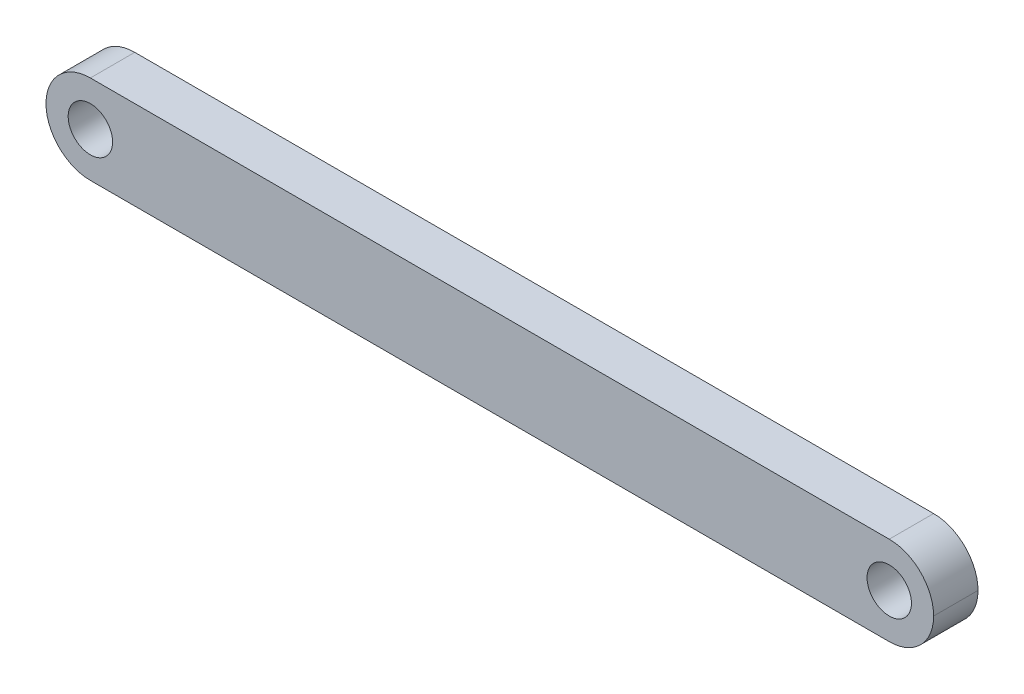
ISO-10303-21;
HEADER;
FILE_DESCRIPTION(('STEP AP214'),'2;1');
FILE_NAME('part.step','',(''),(''),'','','');
FILE_SCHEMA(('AUTOMOTIVE_DESIGN { 1 0 10303 214 1 1 1 1 }'));
ENDSEC;
DATA;
#1=APPLICATION_CONTEXT('core data for automotive mechanical design processes');
#2=APPLICATION_PROTOCOL_DEFINITION('international standard','automotive_design',2000,#1);
#3=PRODUCT_CONTEXT('',#1,'mechanical');
#4=PRODUCT('Part','Part','',(#3));
#5=PRODUCT_RELATED_PRODUCT_CATEGORY('part','',(#4));
#6=PRODUCT_DEFINITION_FORMATION('','',#4);
#7=PRODUCT_DEFINITION_CONTEXT('part definition',#1,'design');
#8=PRODUCT_DEFINITION('design','',#6,#7);
#9=PRODUCT_DEFINITION_SHAPE('','',#8);
#10=(LENGTH_UNIT() NAMED_UNIT(*) SI_UNIT(.MILLI.,.METRE.));
#11=(NAMED_UNIT(*) PLANE_ANGLE_UNIT() SI_UNIT($,.RADIAN.));
#12=(NAMED_UNIT(*) SI_UNIT($,.STERADIAN.) SOLID_ANGLE_UNIT());
#13=UNCERTAINTY_MEASURE_WITH_UNIT(LENGTH_MEASURE(1.E-05),#10,'distance_accuracy_value','');
#14=(GEOMETRIC_REPRESENTATION_CONTEXT(3) GLOBAL_UNCERTAINTY_ASSIGNED_CONTEXT((#13)) GLOBAL_UNIT_ASSIGNED_CONTEXT((#10,
#11,#12)) REPRESENTATION_CONTEXT('',''));
#15=CARTESIAN_POINT('',(0.,0.,0.));
#16=DIRECTION('',(0.,0.,1.));
#17=DIRECTION('',(1.,0.,0.));
#18=AXIS2_PLACEMENT_3D('',#15,#16,#17);
#19=CARTESIAN_POINT('',(0.,0.,10.));
#20=DIRECTION('',(0.,1.,0.));
#21=DIRECTION('',(0.,0.,1.));
#22=AXIS2_PLACEMENT_3D('',#19,#20,#21);
#23=PLANE('',#22);
#24=DIRECTION('',(1.,0.,0.));
#25=VECTOR('',#24,1.);
#26=CARTESIAN_POINT('',(0.,0.,0.));
#27=LINE('',#26,#25);
#28=CARTESIAN_POINT('',(10.,0.,0.));
#29=VERTEX_POINT('',#28);
#30=CARTESIAN_POINT('',(190.,0.,0.));
#31=VERTEX_POINT('',#30);
#32=EDGE_CURVE('E91',#29,#31,#27,.T.);
#33=ORIENTED_EDGE('',*,*,#32,.T.);
#34=DIRECTION('',(0.,0.,-1.));
#35=VECTOR('',#34,1.);
#36=CARTESIAN_POINT('',(190.,0.,10.));
#37=LINE('',#36,#35);
#38=CARTESIAN_POINT('',(190.,0.,10.));
#39=VERTEX_POINT('',#38);
#40=EDGE_CURVE('E133',#31,#39,#37,.F.);
#41=ORIENTED_EDGE('',*,*,#40,.T.);
#42=DIRECTION('',(1.,0.,0.));
#43=VECTOR('',#42,1.);
#44=CARTESIAN_POINT('',(0.,0.,10.));
#45=LINE('',#44,#43);
#46=CARTESIAN_POINT('',(10.,0.,10.));
#47=VERTEX_POINT('',#46);
#48=EDGE_CURVE('E121',#47,#39,#45,.T.);
#49=ORIENTED_EDGE('',*,*,#48,.F.);
#50=DIRECTION('',(0.,0.,-1.));
#51=VECTOR('',#50,1.);
#52=CARTESIAN_POINT('',(10.,0.,10.));
#53=LINE('',#52,#51);
#54=EDGE_CURVE('E131',#47,#29,#53,.T.);
#55=ORIENTED_EDGE('',*,*,#54,.T.);
#56=EDGE_LOOP('',(#33,#41,#49,#55));
#57=FACE_BOUND('',#56,.T.);
#58=ADVANCED_FACE('F32',(#57),#23,.F.);
#59=CARTESIAN_POINT('',(0.,20.,10.));
#60=DIRECTION('',(0.,-1.,0.));
#61=DIRECTION('',(0.,0.,-1.));
#62=AXIS2_PLACEMENT_3D('',#59,#60,#61);
#63=PLANE('',#62);
#64=DIRECTION('',(-1.,0.,0.));
#65=VECTOR('',#64,1.);
#66=CARTESIAN_POINT('',(0.,20.,10.));
#67=LINE('',#66,#65);
#68=CARTESIAN_POINT('',(190.,20.,10.));
#69=VERTEX_POINT('',#68);
#70=CARTESIAN_POINT('',(10.,20.,10.));
#71=VERTEX_POINT('',#70);
#72=EDGE_CURVE('E102',#69,#71,#67,.T.);
#73=ORIENTED_EDGE('',*,*,#72,.F.);
#74=DIRECTION('',(0.,0.,-1.));
#75=VECTOR('',#74,1.);
#76=CARTESIAN_POINT('',(190.,20.,10.));
#77=LINE('',#76,#75);
#78=CARTESIAN_POINT('',(190.,20.,0.));
#79=VERTEX_POINT('',#78);
#80=EDGE_CURVE('E11',#69,#79,#77,.T.);
#81=ORIENTED_EDGE('',*,*,#80,.T.);
#82=DIRECTION('',(-1.,0.,0.));
#83=VECTOR('',#82,1.);
#84=CARTESIAN_POINT('',(0.,20.,0.));
#85=LINE('',#84,#83);
#86=CARTESIAN_POINT('',(10.,20.,0.));
#87=VERTEX_POINT('',#86);
#88=EDGE_CURVE('E124',#79,#87,#85,.T.);
#89=ORIENTED_EDGE('',*,*,#88,.T.);
#90=DIRECTION('',(0.,0.,-1.));
#91=VECTOR('',#90,1.);
#92=CARTESIAN_POINT('',(10.,20.,10.));
#93=LINE('',#92,#91);
#94=EDGE_CURVE('E41',#87,#71,#93,.F.);
#95=ORIENTED_EDGE('',*,*,#94,.T.);
#96=EDGE_LOOP('',(#73,#81,#89,#95));
#97=FACE_BOUND('',#96,.T.);
#98=ADVANCED_FACE('F155',(#97),#63,.F.);
#99=CARTESIAN_POINT('',(0.,0.,10.));
#100=DIRECTION('',(0.,0.,-1.));
#101=DIRECTION('',(-1.,0.,0.));
#102=AXIS2_PLACEMENT_3D('',#99,#100,#101);
#103=PLANE('',#102);
#104=CARTESIAN_POINT('',(190.,10.,10.));
#105=DIRECTION('',(0.,0.,1.));
#106=DIRECTION('',(1.,0.,0.));
#107=AXIS2_PLACEMENT_3D('',#104,#105,#106);
#108=CIRCLE('',#107,4.99999999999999);
#109=CARTESIAN_POINT('',(195.,10.,10.));
#110=VERTEX_POINT('',#109);
#111=EDGE_CURVE('E118',#110,#110,#108,.T.);
#112=ORIENTED_EDGE('',*,*,#111,.F.);
#113=EDGE_LOOP('',(#112));
#114=FACE_BOUND('',#113,.T.);
#115=CARTESIAN_POINT('',(10.,10.,10.));
#116=DIRECTION('',(0.,0.,1.));
#117=DIRECTION('',(1.,0.,0.));
#118=AXIS2_PLACEMENT_3D('',#115,#116,#117);
#119=CIRCLE('',#118,5.);
#120=CARTESIAN_POINT('',(15.,10.,10.));
#121=VERTEX_POINT('',#120);
#122=EDGE_CURVE('E110',#121,#121,#119,.T.);
#123=ORIENTED_EDGE('',*,*,#122,.F.);
#124=EDGE_LOOP('',(#123));
#125=FACE_BOUND('',#124,.T.);
#126=ORIENTED_EDGE('',*,*,#48,.T.);
#127=CARTESIAN_POINT('',(190.,10.,10.));
#128=DIRECTION('',(0.,0.,-1.));
#129=DIRECTION('',(-1.,0.,0.));
#130=AXIS2_PLACEMENT_3D('',#127,#128,#129);
#131=CIRCLE('',#130,10.);
#132=CARTESIAN_POINT('',(200.,10.,10.));
#133=VERTEX_POINT('',#132);
#134=EDGE_CURVE('E140',#39,#133,#131,.F.);
#135=ORIENTED_EDGE('',*,*,#134,.T.);
#136=CARTESIAN_POINT('',(190.,10.,10.));
#137=DIRECTION('',(0.,0.,-1.));
#138=DIRECTION('',(-1.,0.,0.));
#139=AXIS2_PLACEMENT_3D('',#136,#137,#138);
#140=CIRCLE('',#139,10.);
#141=EDGE_CURVE('E55',#133,#69,#140,.F.);
#142=ORIENTED_EDGE('',*,*,#141,.T.);
#143=ORIENTED_EDGE('',*,*,#72,.T.);
#144=CARTESIAN_POINT('',(10.,10.,10.));
#145=DIRECTION('',(0.,0.,-1.));
#146=DIRECTION('',(-1.,0.,0.));
#147=AXIS2_PLACEMENT_3D('',#144,#145,#146);
#148=CIRCLE('',#147,10.);
#149=CARTESIAN_POINT('',(0.,10.,10.));
#150=VERTEX_POINT('',#149);
#151=EDGE_CURVE('E136',#71,#150,#148,.F.);
#152=ORIENTED_EDGE('',*,*,#151,.T.);
#153=CARTESIAN_POINT('',(10.,10.,10.));
#154=DIRECTION('',(0.,0.,-1.));
#155=DIRECTION('',(-1.,0.,0.));
#156=AXIS2_PLACEMENT_3D('',#153,#154,#155);
#157=CIRCLE('',#156,10.);
#158=EDGE_CURVE('E105',#150,#47,#157,.F.);
#159=ORIENTED_EDGE('',*,*,#158,.T.);
#160=EDGE_LOOP('',(#126,#135,#142,#143,#152,#159));
#161=FACE_BOUND('',#160,.T.);
#162=ADVANCED_FACE('F142',(#114,#125,#161),#103,.F.);
#163=CARTESIAN_POINT('',(0.,0.,0.));
#164=DIRECTION('',(0.,0.,-1.));
#165=DIRECTION('',(-1.,0.,0.));
#166=AXIS2_PLACEMENT_3D('',#163,#164,#165);
#167=PLANE('',#166);
#168=CARTESIAN_POINT('',(190.,10.,0.));
#169=DIRECTION('',(0.,0.,1.));
#170=DIRECTION('',(1.,0.,0.));
#171=AXIS2_PLACEMENT_3D('',#168,#169,#170);
#172=CIRCLE('',#171,4.99999999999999);
#173=CARTESIAN_POINT('',(195.,10.,0.));
#174=VERTEX_POINT('',#173);
#175=EDGE_CURVE('E115',#174,#174,#172,.T.);
#176=ORIENTED_EDGE('',*,*,#175,.T.);
#177=EDGE_LOOP('',(#176));
#178=FACE_BOUND('',#177,.T.);
#179=CARTESIAN_POINT('',(10.,10.,0.));
#180=DIRECTION('',(0.,0.,1.));
#181=DIRECTION('',(1.,0.,0.));
#182=AXIS2_PLACEMENT_3D('',#179,#180,#181);
#183=CIRCLE('',#182,5.);
#184=CARTESIAN_POINT('',(15.,10.,0.));
#185=VERTEX_POINT('',#184);
#186=EDGE_CURVE('E107',#185,#185,#183,.T.);
#187=ORIENTED_EDGE('',*,*,#186,.T.);
#188=EDGE_LOOP('',(#187));
#189=FACE_BOUND('',#188,.T.);
#190=CARTESIAN_POINT('',(190.,10.,0.));
#191=DIRECTION('',(0.,0.,-1.));
#192=DIRECTION('',(-1.,0.,0.));
#193=AXIS2_PLACEMENT_3D('',#190,#191,#192);
#194=CIRCLE('',#193,10.);
#195=CARTESIAN_POINT('',(200.,10.,0.));
#196=VERTEX_POINT('',#195);
#197=EDGE_CURVE('E96',#79,#196,#194,.T.);
#198=ORIENTED_EDGE('',*,*,#197,.T.);
#199=CARTESIAN_POINT('',(190.,10.,0.));
#200=DIRECTION('',(0.,0.,-1.));
#201=DIRECTION('',(-1.,0.,0.));
#202=AXIS2_PLACEMENT_3D('',#199,#200,#201);
#203=CIRCLE('',#202,10.);
#204=EDGE_CURVE('E129',#196,#31,#203,.T.);
#205=ORIENTED_EDGE('',*,*,#204,.T.);
#206=ORIENTED_EDGE('',*,*,#32,.F.);
#207=CARTESIAN_POINT('',(10.,10.,0.));
#208=DIRECTION('',(0.,0.,-1.));
#209=DIRECTION('',(-1.,0.,0.));
#210=AXIS2_PLACEMENT_3D('',#207,#208,#209);
#211=CIRCLE('',#210,10.);
#212=CARTESIAN_POINT('',(0.,10.,0.));
#213=VERTEX_POINT('',#212);
#214=EDGE_CURVE('E85',#29,#213,#211,.T.);
#215=ORIENTED_EDGE('',*,*,#214,.T.);
#216=CARTESIAN_POINT('',(10.,10.,0.));
#217=DIRECTION('',(0.,0.,-1.));
#218=DIRECTION('',(-1.,0.,0.));
#219=AXIS2_PLACEMENT_3D('',#216,#217,#218);
#220=CIRCLE('',#219,10.);
#221=EDGE_CURVE('E89',#213,#87,#220,.T.);
#222=ORIENTED_EDGE('',*,*,#221,.T.);
#223=ORIENTED_EDGE('',*,*,#88,.F.);
#224=EDGE_LOOP('',(#198,#205,#206,#215,#222,#223));
#225=FACE_BOUND('',#224,.T.);
#226=ADVANCED_FACE('F87',(#178,#189,#225),#167,.T.);
#227=CARTESIAN_POINT('',(190.,10.,10.));
#228=DIRECTION('',(0.,0.,-1.));
#229=DIRECTION('',(-1.,0.,0.));
#230=AXIS2_PLACEMENT_3D('',#227,#228,#229);
#231=CYLINDRICAL_SURFACE('',#230,10.);
#232=ORIENTED_EDGE('',*,*,#80,.F.);
#233=ORIENTED_EDGE('',*,*,#141,.F.);
#234=DIRECTION('',(0.,0.,-1.));
#235=VECTOR('',#234,1.);
#236=CARTESIAN_POINT('',(200.,10.,10.));
#237=LINE('',#236,#235);
#238=EDGE_CURVE('E106',#196,#133,#237,.F.);
#239=ORIENTED_EDGE('',*,*,#238,.F.);
#240=ORIENTED_EDGE('',*,*,#197,.F.);
#241=EDGE_LOOP('',(#232,#233,#239,#240));
#242=FACE_BOUND('',#241,.T.);
#243=ADVANCED_FACE('F149',(#242),#231,.T.);
#244=CARTESIAN_POINT('',(190.,10.,10.));
#245=DIRECTION('',(0.,0.,-1.));
#246=DIRECTION('',(-1.,0.,0.));
#247=AXIS2_PLACEMENT_3D('',#244,#245,#246);
#248=CYLINDRICAL_SURFACE('',#247,10.);
#249=ORIENTED_EDGE('',*,*,#134,.F.);
#250=ORIENTED_EDGE('',*,*,#40,.F.);
#251=ORIENTED_EDGE('',*,*,#204,.F.);
#252=ORIENTED_EDGE('',*,*,#238,.T.);
#253=EDGE_LOOP('',(#249,#250,#251,#252));
#254=FACE_BOUND('',#253,.T.);
#255=ADVANCED_FACE('F152',(#254),#248,.T.);
#256=CARTESIAN_POINT('',(10.,10.,10.));
#257=DIRECTION('',(0.,0.,-1.));
#258=DIRECTION('',(-1.,0.,0.));
#259=AXIS2_PLACEMENT_3D('',#256,#257,#258);
#260=CYLINDRICAL_SURFACE('',#259,10.);
#261=DIRECTION('',(0.,0.,-1.));
#262=VECTOR('',#261,1.);
#263=CARTESIAN_POINT('',(0.,10.,10.));
#264=LINE('',#263,#262);
#265=EDGE_CURVE('E36',#150,#213,#264,.T.);
#266=ORIENTED_EDGE('',*,*,#265,.F.);
#267=ORIENTED_EDGE('',*,*,#151,.F.);
#268=ORIENTED_EDGE('',*,*,#94,.F.);
#269=ORIENTED_EDGE('',*,*,#221,.F.);
#270=EDGE_LOOP('',(#266,#267,#268,#269));
#271=FACE_BOUND('',#270,.T.);
#272=ADVANCED_FACE('F34',(#271),#260,.T.);
#273=CARTESIAN_POINT('',(10.,10.,10.));
#274=DIRECTION('',(0.,0.,-1.));
#275=DIRECTION('',(-1.,0.,0.));
#276=AXIS2_PLACEMENT_3D('',#273,#274,#275);
#277=CYLINDRICAL_SURFACE('',#276,10.);
#278=ORIENTED_EDGE('',*,*,#158,.F.);
#279=ORIENTED_EDGE('',*,*,#265,.T.);
#280=ORIENTED_EDGE('',*,*,#214,.F.);
#281=ORIENTED_EDGE('',*,*,#54,.F.);
#282=EDGE_LOOP('',(#278,#279,#280,#281));
#283=FACE_BOUND('',#282,.T.);
#284=ADVANCED_FACE('F104',(#283),#277,.T.);
#285=CARTESIAN_POINT('',(10.,10.,0.));
#286=DIRECTION('',(0.,0.,1.));
#287=DIRECTION('',(1.,0.,0.));
#288=AXIS2_PLACEMENT_3D('',#285,#286,#287);
#289=CYLINDRICAL_SURFACE('',#288,5.);
#290=ORIENTED_EDGE('',*,*,#186,.F.);
#291=EDGE_LOOP('',(#290));
#292=FACE_BOUND('',#291,.T.);
#293=ORIENTED_EDGE('',*,*,#122,.T.);
#294=EDGE_LOOP('',(#293));
#295=FACE_BOUND('',#294,.T.);
#296=ADVANCED_FACE('F167',(#292,#295),#289,.F.);
#297=CARTESIAN_POINT('',(190.,10.,0.));
#298=DIRECTION('',(0.,0.,1.));
#299=DIRECTION('',(1.,0.,0.));
#300=AXIS2_PLACEMENT_3D('',#297,#298,#299);
#301=CYLINDRICAL_SURFACE('',#300,4.99999999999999);
#302=ORIENTED_EDGE('',*,*,#175,.F.);
#303=EDGE_LOOP('',(#302));
#304=FACE_BOUND('',#303,.T.);
#305=ORIENTED_EDGE('',*,*,#111,.T.);
#306=EDGE_LOOP('',(#305));
#307=FACE_BOUND('',#306,.T.);
#308=ADVANCED_FACE('F172',(#304,#307),#301,.F.);
#309=CLOSED_SHELL('',(#58,#98,#162,#226,#243,#255,#272,#284,#296,#308));
#310=MANIFOLD_SOLID_BREP('B2',#309);
#311=ADVANCED_BREP_SHAPE_REPRESENTATION('',(#18,#310),#14);
#312=SHAPE_DEFINITION_REPRESENTATION(#9,#311);
ENDSEC;
END-ISO-10303-21;
